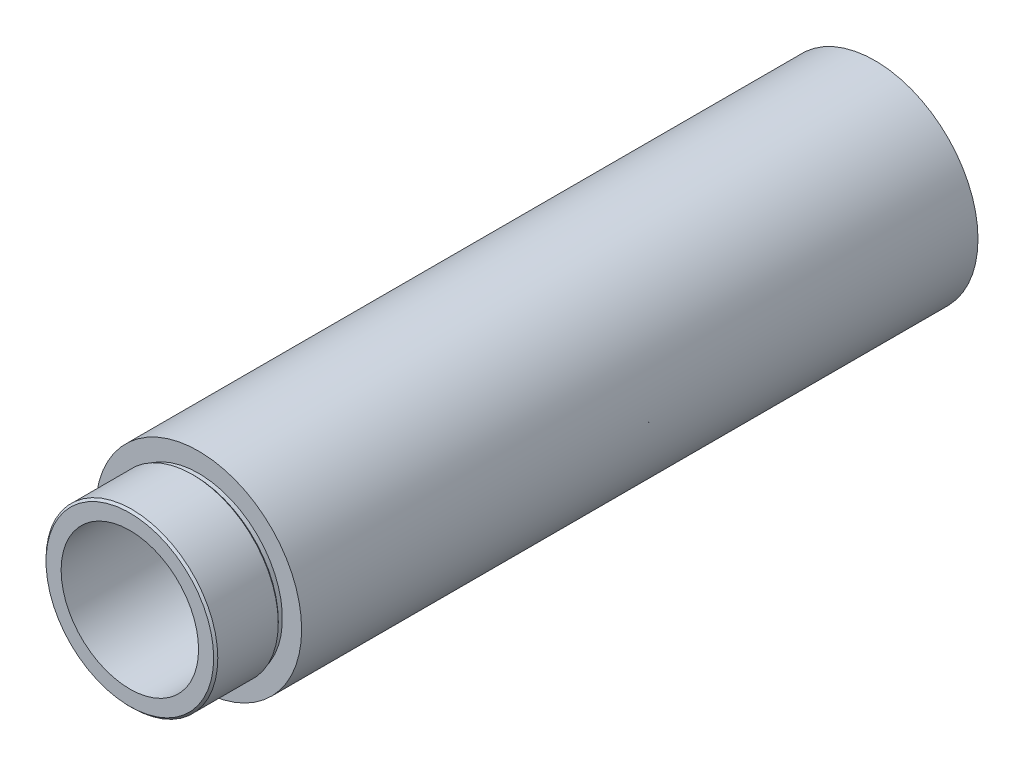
ISO-10303-21;
HEADER;
FILE_DESCRIPTION(('STEP AP214'),'2;1');
FILE_NAME('part.step','',(''),(''),'','','');
FILE_SCHEMA(('AUTOMOTIVE_DESIGN { 1 0 10303 214 1 1 1 1 }'));
ENDSEC;
DATA;
#1=APPLICATION_CONTEXT('core data for automotive mechanical design processes');
#2=APPLICATION_PROTOCOL_DEFINITION('international standard','automotive_design',2000,#1);
#3=PRODUCT_CONTEXT('',#1,'mechanical');
#4=PRODUCT('Part','Part','',(#3));
#5=PRODUCT_RELATED_PRODUCT_CATEGORY('part','',(#4));
#6=PRODUCT_DEFINITION_FORMATION('','',#4);
#7=PRODUCT_DEFINITION_CONTEXT('part definition',#1,'design');
#8=PRODUCT_DEFINITION('design','',#6,#7);
#9=PRODUCT_DEFINITION_SHAPE('','',#8);
#10=(LENGTH_UNIT() NAMED_UNIT(*) SI_UNIT(.MILLI.,.METRE.));
#11=(NAMED_UNIT(*) PLANE_ANGLE_UNIT() SI_UNIT($,.RADIAN.));
#12=(NAMED_UNIT(*) SI_UNIT($,.STERADIAN.) SOLID_ANGLE_UNIT());
#13=UNCERTAINTY_MEASURE_WITH_UNIT(LENGTH_MEASURE(1.E-05),#10,'distance_accuracy_value','');
#14=(GEOMETRIC_REPRESENTATION_CONTEXT(3) GLOBAL_UNCERTAINTY_ASSIGNED_CONTEXT((#13)) GLOBAL_UNIT_ASSIGNED_CONTEXT((#10,
#11,#12)) REPRESENTATION_CONTEXT('',''));
#15=CARTESIAN_POINT('',(0.,0.,0.));
#16=DIRECTION('',(0.,0.,1.));
#17=DIRECTION('',(1.,0.,0.));
#18=AXIS2_PLACEMENT_3D('',#15,#16,#17);
#19=CARTESIAN_POINT('',(0.,0.,125.));
#20=DIRECTION('',(0.,0.,1.));
#21=DIRECTION('',(1.,0.,0.));
#22=AXIS2_PLACEMENT_3D('',#19,#20,#21);
#23=PLANE('',#22);
#24=CARTESIAN_POINT('',(0.,0.,125.));
#25=DIRECTION('',(0.,0.,1.));
#26=DIRECTION('',(1.,0.,0.));
#27=AXIS2_PLACEMENT_3D('',#24,#25,#26);
#28=CIRCLE('',#27,19.05);
#29=CARTESIAN_POINT('',(19.05,0.,125.));
#30=VERTEX_POINT('',#29);
#31=EDGE_CURVE('E34',#30,#30,#28,.T.);
#32=ORIENTED_EDGE('',*,*,#31,.T.);
#33=EDGE_LOOP('',(#32));
#34=FACE_BOUND('',#33,.T.);
#35=CARTESIAN_POINT('',(0.,0.,125.));
#36=DIRECTION('',(0.,0.,1.));
#37=DIRECTION('',(1.,0.,0.));
#38=AXIS2_PLACEMENT_3D('',#35,#36,#37);
#39=CIRCLE('',#38,15.494);
#40=CARTESIAN_POINT('',(-15.494,0.,125.));
#41=VERTEX_POINT('',#40);
#42=EDGE_CURVE('E45',#41,#41,#39,.T.);
#43=ORIENTED_EDGE('',*,*,#42,.F.);
#44=EDGE_LOOP('',(#43));
#45=FACE_BOUND('',#44,.T.);
#46=ADVANCED_FACE('F13',(#34,#45),#23,.T.);
#47=CARTESIAN_POINT('',(0.,0.,0.));
#48=DIRECTION('',(0.,0.,1.));
#49=DIRECTION('',(1.,0.,0.));
#50=AXIS2_PLACEMENT_3D('',#47,#48,#49);
#51=PLANE('',#50);
#52=CARTESIAN_POINT('',(0.,0.,0.));
#53=DIRECTION('',(0.,0.,1.));
#54=DIRECTION('',(1.,0.,0.));
#55=AXIS2_PLACEMENT_3D('',#52,#53,#54);
#56=CIRCLE('',#55,15.875);
#57=CARTESIAN_POINT('',(15.875,0.,0.));
#58=VERTEX_POINT('',#57);
#59=EDGE_CURVE('E72',#58,#58,#56,.T.);
#60=ORIENTED_EDGE('',*,*,#59,.T.);
#61=EDGE_LOOP('',(#60));
#62=FACE_BOUND('',#61,.T.);
#63=CARTESIAN_POINT('',(0.,0.,0.));
#64=DIRECTION('',(0.,0.,1.));
#65=DIRECTION('',(1.,0.,0.));
#66=AXIS2_PLACEMENT_3D('',#63,#64,#65);
#67=CIRCLE('',#66,19.05);
#68=CARTESIAN_POINT('',(19.05,0.,0.));
#69=VERTEX_POINT('',#68);
#70=EDGE_CURVE('E37',#69,#69,#67,.T.);
#71=ORIENTED_EDGE('',*,*,#70,.F.);
#72=EDGE_LOOP('',(#71));
#73=FACE_BOUND('',#72,.T.);
#74=ADVANCED_FACE('F111',(#62,#73),#51,.F.);
#75=CARTESIAN_POINT('',(0.,0.,125.));
#76=DIRECTION('',(0.,0.,-1.));
#77=DIRECTION('',(-1.,0.,0.));
#78=AXIS2_PLACEMENT_3D('',#75,#76,#77);
#79=CYLINDRICAL_SURFACE('',#78,19.05);
#80=ORIENTED_EDGE('',*,*,#31,.F.);
#81=EDGE_LOOP('',(#80));
#82=FACE_BOUND('',#81,.T.);
#83=ORIENTED_EDGE('',*,*,#70,.T.);
#84=EDGE_LOOP('',(#83));
#85=FACE_BOUND('',#84,.T.);
#86=ADVANCED_FACE('F92',(#82,#85),#79,.T.);
#87=CARTESIAN_POINT('',(0.,0.,137.7));
#88=DIRECTION('',(0.,0.,1.));
#89=DIRECTION('',(1.,0.,0.));
#90=AXIS2_PLACEMENT_3D('',#87,#88,#89);
#91=PLANE('',#90);
#92=CARTESIAN_POINT('',(0.,0.,137.7));
#93=DIRECTION('',(0.,0.,1.));
#94=DIRECTION('',(1.,0.,0.));
#95=AXIS2_PLACEMENT_3D('',#92,#93,#94);
#96=CIRCLE('',#95,12.7);
#97=CARTESIAN_POINT('',(12.7,0.,137.7));
#98=VERTEX_POINT('',#97);
#99=EDGE_CURVE('E76',#98,#98,#96,.T.);
#100=ORIENTED_EDGE('',*,*,#99,.F.);
#101=EDGE_LOOP('',(#100));
#102=FACE_BOUND('',#101,.T.);
#103=CARTESIAN_POINT('',(0.,0.,137.7));
#104=DIRECTION('',(0.,0.,1.));
#105=DIRECTION('',(1.,0.,0.));
#106=AXIS2_PLACEMENT_3D('',#103,#104,#105);
#107=CIRCLE('',#106,15.494);
#108=CARTESIAN_POINT('',(15.494,0.,137.7));
#109=VERTEX_POINT('',#108);
#110=EDGE_CURVE('E28',#109,#109,#107,.T.);
#111=ORIENTED_EDGE('',*,*,#110,.T.);
#112=EDGE_LOOP('',(#111));
#113=FACE_BOUND('',#112,.T.);
#114=ADVANCED_FACE('F88',(#102,#113),#91,.T.);
#115=CARTESIAN_POINT('',(0.,0.,137.7));
#116=DIRECTION('',(0.,0.,-1.));
#117=DIRECTION('',(-1.,0.,0.));
#118=AXIS2_PLACEMENT_3D('',#115,#116,#117);
#119=CYLINDRICAL_SURFACE('',#118,15.875);
#120=CARTESIAN_POINT('',(0.,0.,137.319));
#121=DIRECTION('',(0.,0.,1.));
#122=DIRECTION('',(1.,0.,0.));
#123=AXIS2_PLACEMENT_3D('',#120,#121,#122);
#124=CIRCLE('',#123,15.875);
#125=CARTESIAN_POINT('',(15.875,0.,137.319));
#126=VERTEX_POINT('',#125);
#127=EDGE_CURVE('E9',#126,#126,#124,.F.);
#128=ORIENTED_EDGE('',*,*,#127,.T.);
#129=EDGE_LOOP('',(#128));
#130=FACE_BOUND('',#129,.T.);
#131=CARTESIAN_POINT('',(0.,0.,126.143));
#132=DIRECTION('',(0.,0.,1.));
#133=DIRECTION('',(1.,0.,0.));
#134=AXIS2_PLACEMENT_3D('',#131,#132,#133);
#135=CIRCLE('',#134,15.875);
#136=CARTESIAN_POINT('',(15.875,0.,126.143));
#137=VERTEX_POINT('',#136);
#138=EDGE_CURVE('E21',#137,#137,#135,.T.);
#139=ORIENTED_EDGE('',*,*,#138,.T.);
#140=EDGE_LOOP('',(#139));
#141=FACE_BOUND('',#140,.T.);
#142=ADVANCED_FACE('F91',(#130,#141),#119,.T.);
#143=CARTESIAN_POINT('',(0.,0.,125.762));
#144=DIRECTION('',(0.,0.,-1.));
#145=DIRECTION('',(-1.,0.,0.));
#146=AXIS2_PLACEMENT_3D('',#143,#144,#145);
#147=CYLINDRICAL_SURFACE('',#146,15.494);
#148=CARTESIAN_POINT('',(0.,0.,125.762));
#149=DIRECTION('',(0.,0.,1.));
#150=DIRECTION('',(1.,0.,0.));
#151=AXIS2_PLACEMENT_3D('',#148,#149,#150);
#152=CIRCLE('',#151,15.494);
#153=CARTESIAN_POINT('',(-15.494,0.,125.762));
#154=VERTEX_POINT('',#153);
#155=EDGE_CURVE('E41',#154,#154,#152,.T.);
#156=CARTESIAN_POINT('',(-15.494,0.,125.762));
#157=CARTESIAN_POINT('',(-15.494,0.,125.7540625));
#158=CARTESIAN_POINT('',(-15.494,0.,125.746125));
#159=CARTESIAN_POINT('',(-15.494,0.,125.73025));
#160=CARTESIAN_POINT('',(-15.494,0.,125.7223125));
#161=CARTESIAN_POINT('',(-15.494,0.,125.7064375));
#162=CARTESIAN_POINT('',(-15.494,0.,125.6985));
#163=CARTESIAN_POINT('',(-15.494,0.,125.682625));
#164=CARTESIAN_POINT('',(-15.494,0.,125.6746875));
#165=CARTESIAN_POINT('',(-15.494,0.,125.6588125));
#166=CARTESIAN_POINT('',(-15.494,0.,125.650875));
#167=CARTESIAN_POINT('',(-15.494,0.,125.635));
#168=CARTESIAN_POINT('',(-15.494,0.,125.6270625));
#169=CARTESIAN_POINT('',(-15.494,0.,125.6111875));
#170=CARTESIAN_POINT('',(-15.494,0.,125.60325));
#171=CARTESIAN_POINT('',(-15.494,0.,125.587375));
#172=CARTESIAN_POINT('',(-15.494,0.,125.5794375));
#173=CARTESIAN_POINT('',(-15.494,0.,125.5635625));
#174=CARTESIAN_POINT('',(-15.494,0.,125.555625));
#175=CARTESIAN_POINT('',(-15.494,0.,125.53975));
#176=CARTESIAN_POINT('',(-15.494,0.,125.5318125));
#177=CARTESIAN_POINT('',(-15.494,0.,125.5159375));
#178=CARTESIAN_POINT('',(-15.494,0.,125.508));
#179=CARTESIAN_POINT('',(-15.494,0.,125.492125));
#180=CARTESIAN_POINT('',(-15.494,0.,125.4841875));
#181=CARTESIAN_POINT('',(-15.494,0.,125.4683125));
#182=CARTESIAN_POINT('',(-15.494,0.,125.460375));
#183=CARTESIAN_POINT('',(-15.494,0.,125.4445));
#184=CARTESIAN_POINT('',(-15.494,0.,125.4365625));
#185=CARTESIAN_POINT('',(-15.494,0.,125.4206875));
#186=CARTESIAN_POINT('',(-15.494,0.,125.41275));
#187=CARTESIAN_POINT('',(-15.494,0.,125.396875));
#188=CARTESIAN_POINT('',(-15.494,0.,125.3889375));
#189=CARTESIAN_POINT('',(-15.494,0.,125.3730625));
#190=CARTESIAN_POINT('',(-15.494,0.,125.365125));
#191=CARTESIAN_POINT('',(-15.494,0.,125.34925));
#192=CARTESIAN_POINT('',(-15.494,0.,125.3413125));
#193=CARTESIAN_POINT('',(-15.494,0.,125.3254375));
#194=CARTESIAN_POINT('',(-15.494,0.,125.3175));
#195=CARTESIAN_POINT('',(-15.494,0.,125.301625));
#196=CARTESIAN_POINT('',(-15.494,0.,125.2936875));
#197=CARTESIAN_POINT('',(-15.494,0.,125.2778125));
#198=CARTESIAN_POINT('',(-15.494,0.,125.269875));
#199=CARTESIAN_POINT('',(-15.494,0.,125.254));
#200=CARTESIAN_POINT('',(-15.494,0.,125.2460625));
#201=CARTESIAN_POINT('',(-15.494,0.,125.2301875));
#202=CARTESIAN_POINT('',(-15.494,0.,125.22225));
#203=CARTESIAN_POINT('',(-15.494,0.,125.206375));
#204=CARTESIAN_POINT('',(-15.494,0.,125.1984375));
#205=CARTESIAN_POINT('',(-15.494,0.,125.1825625));
#206=CARTESIAN_POINT('',(-15.494,0.,125.174625));
#207=CARTESIAN_POINT('',(-15.494,0.,125.15875));
#208=CARTESIAN_POINT('',(-15.494,0.,125.1508125));
#209=CARTESIAN_POINT('',(-15.494,0.,125.1349375));
#210=CARTESIAN_POINT('',(-15.494,0.,125.127));
#211=CARTESIAN_POINT('',(-15.494,0.,125.111125));
#212=CARTESIAN_POINT('',(-15.494,0.,125.1031875));
#213=CARTESIAN_POINT('',(-15.494,0.,125.0873125));
#214=CARTESIAN_POINT('',(-15.494,0.,125.079375));
#215=CARTESIAN_POINT('',(-15.494,0.,125.0635));
#216=CARTESIAN_POINT('',(-15.494,0.,125.0555625));
#217=CARTESIAN_POINT('',(-15.494,0.,125.0396875));
#218=CARTESIAN_POINT('',(-15.494,0.,125.03175));
#219=CARTESIAN_POINT('',(-15.494,0.,125.015875));
#220=CARTESIAN_POINT('',(-15.494,0.,125.0079375));
#221=CARTESIAN_POINT('',(-15.494,0.,125.));
#222=B_SPLINE_CURVE_WITH_KNOTS('',3,(#156,#157,#158,#159,#160,#161,#162,#163,#164,#165,#166,
#167,#168,#169,#170,#171,#172,#173,#174,#175,#176,#177,#178,#179,#180,#181,#182,#183,#184,#185,
#186,#187,#188,#189,#190,#191,#192,#193,#194,#195,#196,#197,#198,#199,#200,#201,#202,#203,#204,
#205,#206,#207,#208,#209,#210,#211,#212,#213,#214,#215,#216,#217,#218,#219,#220,#221),
.UNSPECIFIED.,.F.,.F.,(4,2,2,2,2,2,2,2,2,2,2,2,2,2,2,2,2,2,2,2,2,2,2,2,2,2,2,2,2,2,2,2,4),(0.,
0.0238124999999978,0.0476249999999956,0.0714374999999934,0.0952499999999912,0.119062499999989,
0.142874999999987,0.166687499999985,0.190499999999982,0.21431249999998,0.238124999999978,
0.261937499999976,0.285750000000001,0.309562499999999,0.333374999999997,0.357187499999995,
0.380999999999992,0.40481249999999,0.428624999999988,0.452437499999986,0.476249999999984,
0.500062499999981,0.523874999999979,0.547687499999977,0.571500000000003,0.5953125,
0.619124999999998,0.642937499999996,0.666749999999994,0.690562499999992,0.714374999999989,
0.738187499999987,0.761999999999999),.UNSPECIFIED.);
#223=EDGE_CURVE('BSEAM98',#154,#41,#222,.T.);
#224=ORIENTED_EDGE('',*,*,#155,.F.);
#225=ORIENTED_EDGE('',*,*,#42,.T.);
#226=ORIENTED_EDGE('',*,*,#223,.T.);
#227=ORIENTED_EDGE('',*,*,#223,.F.);
#228=EDGE_LOOP('',(#224,#226,#225,#227));
#229=FACE_BOUND('',#228,.T.);
#230=ADVANCED_FACE('F98',(#229),#147,.T.);
#231=CARTESIAN_POINT('',(0.,0.,137.7));
#232=DIRECTION('',(0.,0.,-1.));
#233=DIRECTION('',(-1.,0.,0.));
#234=AXIS2_PLACEMENT_3D('',#231,#232,#233);
#235=CONICAL_SURFACE('',#234,15.494,0.785398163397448);
#236=ORIENTED_EDGE('',*,*,#127,.F.);
#237=EDGE_LOOP('',(#236));
#238=FACE_BOUND('',#237,.T.);
#239=ORIENTED_EDGE('',*,*,#110,.F.);
#240=EDGE_LOOP('',(#239));
#241=FACE_BOUND('',#240,.T.);
#242=ADVANCED_FACE('F96',(#238,#241),#235,.T.);
#243=CARTESIAN_POINT('',(0.,0.,126.143));
#244=DIRECTION('',(0.,0.,1.));
#245=DIRECTION('',(1.,0.,0.));
#246=AXIS2_PLACEMENT_3D('',#243,#244,#245);
#247=CONICAL_SURFACE('',#246,15.875,0.785398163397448);
#248=ORIENTED_EDGE('',*,*,#155,.T.);
#249=EDGE_LOOP('',(#248));
#250=FACE_BOUND('',#249,.T.);
#251=ORIENTED_EDGE('',*,*,#138,.F.);
#252=EDGE_LOOP('',(#251));
#253=FACE_BOUND('',#252,.T.);
#254=ADVANCED_FACE('F15',(#250,#253),#247,.T.);
#255=CARTESIAN_POINT('',(0.,0.,0.381000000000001));
#256=DIRECTION('',(0.,0.,-1.));
#257=DIRECTION('',(-1.,0.,0.));
#258=AXIS2_PLACEMENT_3D('',#255,#256,#257);
#259=CONICAL_SURFACE('',#258,15.494,0.785398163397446);
#260=ORIENTED_EDGE('',*,*,#59,.F.);
#261=EDGE_LOOP('',(#260));
#262=FACE_BOUND('',#261,.T.);
#263=CARTESIAN_POINT('',(0.,0.,0.381000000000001));
#264=DIRECTION('',(0.,0.,1.));
#265=DIRECTION('',(1.,0.,0.));
#266=AXIS2_PLACEMENT_3D('',#263,#264,#265);
#267=CIRCLE('',#266,15.494);
#268=CARTESIAN_POINT('',(15.494,0.,0.381000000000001));
#269=VERTEX_POINT('',#268);
#270=EDGE_CURVE('E49',#269,#269,#267,.F.);
#271=ORIENTED_EDGE('',*,*,#270,.F.);
#272=EDGE_LOOP('',(#271));
#273=FACE_BOUND('',#272,.T.);
#274=ADVANCED_FACE('F105',(#262,#273),#259,.F.);
#275=CARTESIAN_POINT('',(0.,0.,12.7));
#276=DIRECTION('',(0.,0.,-1.));
#277=DIRECTION('',(-1.,0.,0.));
#278=AXIS2_PLACEMENT_3D('',#275,#276,#277);
#279=CYLINDRICAL_SURFACE('',#278,15.494);
#280=ORIENTED_EDGE('',*,*,#270,.T.);
#281=EDGE_LOOP('',(#280));
#282=FACE_BOUND('',#281,.T.);
#283=CARTESIAN_POINT('',(0.,0.,11.557));
#284=DIRECTION('',(0.,0.,-1.));
#285=DIRECTION('',(-1.,0.,0.));
#286=AXIS2_PLACEMENT_3D('',#283,#284,#285);
#287=CIRCLE('',#286,15.494);
#288=CARTESIAN_POINT('',(-15.494,0.,11.557));
#289=VERTEX_POINT('',#288);
#290=EDGE_CURVE('E56',#289,#289,#287,.F.);
#291=ORIENTED_EDGE('',*,*,#290,.T.);
#292=EDGE_LOOP('',(#291));
#293=FACE_BOUND('',#292,.T.);
#294=ADVANCED_FACE('F176',(#282,#293),#279,.F.);
#295=CARTESIAN_POINT('',(0.,0.,11.557));
#296=DIRECTION('',(0.,0.,1.));
#297=DIRECTION('',(1.,0.,0.));
#298=AXIS2_PLACEMENT_3D('',#295,#296,#297);
#299=CONICAL_SURFACE('',#298,15.494,0.785398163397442);
#300=CARTESIAN_POINT('',(0.,0.,11.938));
#301=DIRECTION('',(0.,0.,-1.));
#302=DIRECTION('',(-1.,0.,0.));
#303=AXIS2_PLACEMENT_3D('',#300,#301,#302);
#304=CIRCLE('',#303,15.875);
#305=CARTESIAN_POINT('',(15.875,0.,11.938));
#306=VERTEX_POINT('',#305);
#307=EDGE_CURVE('E60',#306,#306,#304,.T.);
#308=ORIENTED_EDGE('',*,*,#307,.F.);
#309=EDGE_LOOP('',(#308));
#310=FACE_BOUND('',#309,.T.);
#311=ORIENTED_EDGE('',*,*,#290,.F.);
#312=EDGE_LOOP('',(#311));
#313=FACE_BOUND('',#312,.T.);
#314=ADVANCED_FACE('F185',(#310,#313),#299,.F.);
#315=CARTESIAN_POINT('',(0.,0.,11.938));
#316=DIRECTION('',(0.,0.,1.));
#317=DIRECTION('',(1.,0.,0.));
#318=AXIS2_PLACEMENT_3D('',#315,#316,#317);
#319=CYLINDRICAL_SURFACE('',#318,15.875);
#320=CARTESIAN_POINT('',(0.,0.,12.7));
#321=DIRECTION('',(0.,0.,-1.));
#322=DIRECTION('',(-1.,0.,0.));
#323=AXIS2_PLACEMENT_3D('',#320,#321,#322);
#324=CIRCLE('',#323,15.875);
#325=CARTESIAN_POINT('',(15.875,0.,12.7));
#326=VERTEX_POINT('',#325);
#327=EDGE_CURVE('E64',#326,#326,#324,.T.);
#328=CARTESIAN_POINT('',(15.875,0.,11.938));
#329=CARTESIAN_POINT('',(15.875,0.,11.9459375));
#330=CARTESIAN_POINT('',(15.875,0.,11.953875));
#331=CARTESIAN_POINT('',(15.875,0.,11.96975));
#332=CARTESIAN_POINT('',(15.875,0.,11.9776875));
#333=CARTESIAN_POINT('',(15.875,0.,11.9935625));
#334=CARTESIAN_POINT('',(15.875,0.,12.0015));
#335=CARTESIAN_POINT('',(15.875,0.,12.017375));
#336=CARTESIAN_POINT('',(15.875,0.,12.0253125));
#337=CARTESIAN_POINT('',(15.875,0.,12.0411875));
#338=CARTESIAN_POINT('',(15.875,0.,12.049125));
#339=CARTESIAN_POINT('',(15.875,0.,12.065));
#340=CARTESIAN_POINT('',(15.875,0.,12.0729375));
#341=CARTESIAN_POINT('',(15.875,0.,12.0888125));
#342=CARTESIAN_POINT('',(15.875,0.,12.09675));
#343=CARTESIAN_POINT('',(15.875,0.,12.112625));
#344=CARTESIAN_POINT('',(15.875,0.,12.1205625));
#345=CARTESIAN_POINT('',(15.875,0.,12.1364375));
#346=CARTESIAN_POINT('',(15.875,0.,12.144375));
#347=CARTESIAN_POINT('',(15.875,0.,12.16025));
#348=CARTESIAN_POINT('',(15.875,0.,12.1681875));
#349=CARTESIAN_POINT('',(15.875,0.,12.1840625));
#350=CARTESIAN_POINT('',(15.875,0.,12.192));
#351=CARTESIAN_POINT('',(15.875,0.,12.207875));
#352=CARTESIAN_POINT('',(15.875,0.,12.2158125));
#353=CARTESIAN_POINT('',(15.875,0.,12.2316875));
#354=CARTESIAN_POINT('',(15.875,0.,12.239625));
#355=CARTESIAN_POINT('',(15.875,0.,12.2555));
#356=CARTESIAN_POINT('',(15.875,0.,12.2634375));
#357=CARTESIAN_POINT('',(15.875,0.,12.2793125));
#358=CARTESIAN_POINT('',(15.875,0.,12.28725));
#359=CARTESIAN_POINT('',(15.875,0.,12.303125));
#360=CARTESIAN_POINT('',(15.875,0.,12.3110625));
#361=CARTESIAN_POINT('',(15.875,0.,12.3269375));
#362=CARTESIAN_POINT('',(15.875,0.,12.334875));
#363=CARTESIAN_POINT('',(15.875,0.,12.35075));
#364=CARTESIAN_POINT('',(15.875,0.,12.3586875));
#365=CARTESIAN_POINT('',(15.875,0.,12.3745625));
#366=CARTESIAN_POINT('',(15.875,0.,12.3825));
#367=CARTESIAN_POINT('',(15.875,0.,12.398375));
#368=CARTESIAN_POINT('',(15.875,0.,12.4063125));
#369=CARTESIAN_POINT('',(15.875,0.,12.4221875));
#370=CARTESIAN_POINT('',(15.875,0.,12.430125));
#371=CARTESIAN_POINT('',(15.875,0.,12.446));
#372=CARTESIAN_POINT('',(15.875,0.,12.4539375));
#373=CARTESIAN_POINT('',(15.875,0.,12.4698125));
#374=CARTESIAN_POINT('',(15.875,0.,12.47775));
#375=CARTESIAN_POINT('',(15.875,0.,12.493625));
#376=CARTESIAN_POINT('',(15.875,0.,12.5015625));
#377=CARTESIAN_POINT('',(15.875,0.,12.5174375));
#378=CARTESIAN_POINT('',(15.875,0.,12.525375));
#379=CARTESIAN_POINT('',(15.875,0.,12.54125));
#380=CARTESIAN_POINT('',(15.875,0.,12.5491875));
#381=CARTESIAN_POINT('',(15.875,0.,12.5650625));
#382=CARTESIAN_POINT('',(15.875,0.,12.573));
#383=CARTESIAN_POINT('',(15.875,0.,12.588875));
#384=CARTESIAN_POINT('',(15.875,0.,12.5968125));
#385=CARTESIAN_POINT('',(15.875,0.,12.6126875));
#386=CARTESIAN_POINT('',(15.875,0.,12.620625));
#387=CARTESIAN_POINT('',(15.875,0.,12.6365));
#388=CARTESIAN_POINT('',(15.875,0.,12.6444375));
#389=CARTESIAN_POINT('',(15.875,0.,12.6603125));
#390=CARTESIAN_POINT('',(15.875,0.,12.66825));
#391=CARTESIAN_POINT('',(15.875,0.,12.684125));
#392=CARTESIAN_POINT('',(15.875,0.,12.6920625));
#393=CARTESIAN_POINT('',(15.875,0.,12.7));
#394=B_SPLINE_CURVE_WITH_KNOTS('',3,(#328,#329,#330,#331,#332,#333,#334,#335,#336,#337,#338,
#339,#340,#341,#342,#343,#344,#345,#346,#347,#348,#349,#350,#351,#352,#353,#354,#355,#356,#357,
#358,#359,#360,#361,#362,#363,#364,#365,#366,#367,#368,#369,#370,#371,#372,#373,#374,#375,#376,
#377,#378,#379,#380,#381,#382,#383,#384,#385,#386,#387,#388,#389,#390,#391,#392,#393),
.UNSPECIFIED.,.F.,.F.,(4,2,2,2,2,2,2,2,2,2,2,2,2,2,2,2,2,2,2,2,2,2,2,2,2,2,2,2,2,2,2,2,4),(0.,
0.0238125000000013,0.0476250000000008,0.0714375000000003,0.0952500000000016,0.119062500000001,
0.142875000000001,0.1666875,0.190500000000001,0.214312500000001,0.238125,0.261937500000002,
0.285750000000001,0.309562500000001,0.333375,0.357187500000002,0.381000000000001,
0.404812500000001,0.428625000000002,0.452437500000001,0.476250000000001,0.500062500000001,
0.523875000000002,0.547687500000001,0.571500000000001,0.595312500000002,0.619125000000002,
0.642937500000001,0.666750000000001,0.690562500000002,0.714375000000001,0.738187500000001,
0.762000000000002),.UNSPECIFIED.);
#395=EDGE_CURVE('BSEAM201',#306,#326,#394,.T.);
#396=ORIENTED_EDGE('',*,*,#307,.T.);
#397=ORIENTED_EDGE('',*,*,#327,.F.);
#398=ORIENTED_EDGE('',*,*,#395,.T.);
#399=ORIENTED_EDGE('',*,*,#395,.F.);
#400=EDGE_LOOP('',(#396,#398,#397,#399));
#401=FACE_BOUND('',#400,.T.);
#402=ADVANCED_FACE('F201',(#401),#319,.F.);
#403=CARTESIAN_POINT('',(0.,0.,12.7));
#404=DIRECTION('',(0.,0.,-1.));
#405=DIRECTION('',(-1.,0.,0.));
#406=AXIS2_PLACEMENT_3D('',#403,#404,#405);
#407=PLANE('',#406);
#408=CARTESIAN_POINT('',(0.,0.,12.7));
#409=DIRECTION('',(0.,0.,-1.));
#410=DIRECTION('',(-1.,0.,0.));
#411=AXIS2_PLACEMENT_3D('',#408,#409,#410);
#412=CIRCLE('',#411,12.7);
#413=CARTESIAN_POINT('',(-12.7,0.,12.7));
#414=VERTEX_POINT('',#413);
#415=EDGE_CURVE('E68',#414,#414,#412,.T.);
#416=ORIENTED_EDGE('',*,*,#415,.F.);
#417=EDGE_LOOP('',(#416));
#418=FACE_BOUND('',#417,.T.);
#419=ORIENTED_EDGE('',*,*,#327,.T.);
#420=EDGE_LOOP('',(#419));
#421=FACE_BOUND('',#420,.T.);
#422=ADVANCED_FACE('F214',(#418,#421),#407,.T.);
#423=CARTESIAN_POINT('',(0.,0.,125.));
#424=DIRECTION('',(0.,0.,-1.));
#425=DIRECTION('',(-1.,0.,0.));
#426=AXIS2_PLACEMENT_3D('',#423,#424,#425);
#427=CYLINDRICAL_SURFACE('',#426,12.7);
#428=ORIENTED_EDGE('',*,*,#99,.T.);
#429=EDGE_LOOP('',(#428));
#430=FACE_BOUND('',#429,.T.);
#431=ORIENTED_EDGE('',*,*,#415,.T.);
#432=EDGE_LOOP('',(#431));
#433=FACE_BOUND('',#432,.T.);
#434=ADVANCED_FACE('F85',(#430,#433),#427,.F.);
#435=CLOSED_SHELL('',(#46,#74,#86,#114,#142,#230,#242,#254,#274,#294,#314,#402,#422,#434));
#436=MANIFOLD_SOLID_BREP('B1',#435);
#437=ADVANCED_BREP_SHAPE_REPRESENTATION('',(#18,#436),#14);
#438=SHAPE_DEFINITION_REPRESENTATION(#9,#437);
ENDSEC;
END-ISO-10303-21;
